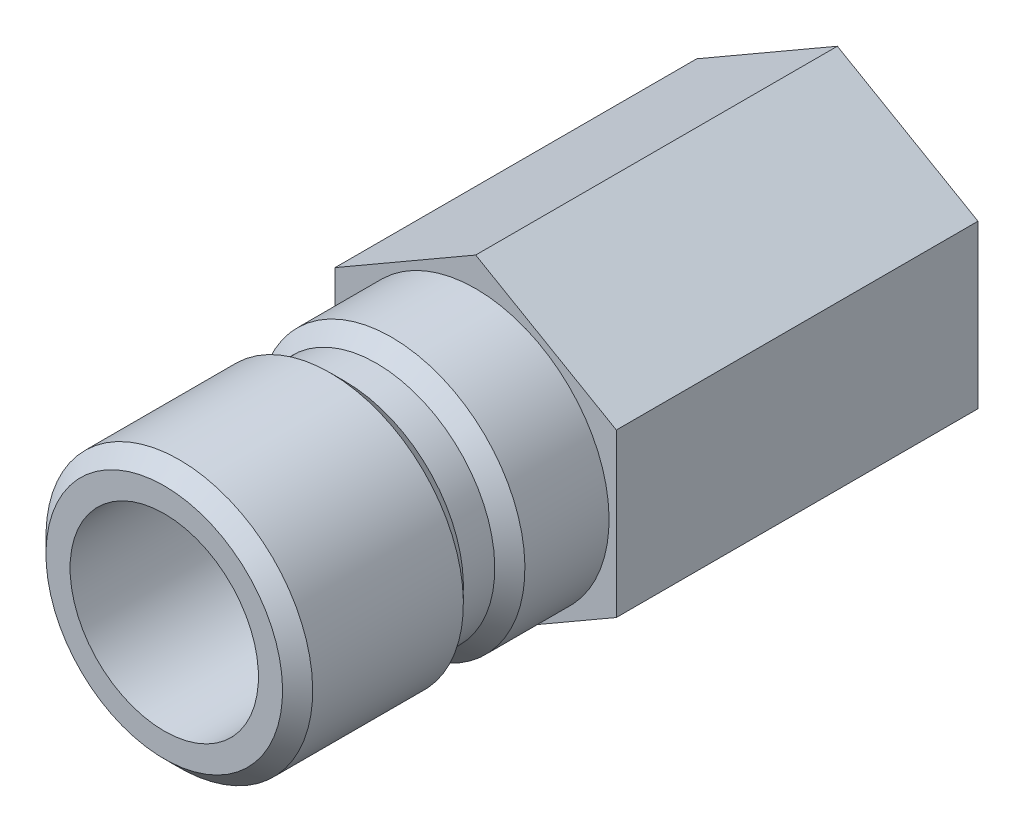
from build123d import *

# Parameters (mm, degrees)
SKETCH2_OUTSIDE_W  = 27.872
SKETCH2_OUTSIDE_H  = 27.872
CUT_EXTRUDE1_DEPTH = 23.066272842


with BuildPart() as part:
    # Sketch1 → Revolve1 (revolve)
    with BuildSketch(Plane(origin=(0, 0, 0), x_dir=(0, 0, -1), z_dir=(1, 0, 0))):
        Polygon((-15.748, 4.7625), (-15.748, 5.9817), (-14.986, 6.7437), (-7.366, 6.7437), (-6.604, 5.9817), (-5.0165, 5.9817), (-4.2545, 6.7437), (0, 6.7437), (0, 8.73125), (18.288, 8.73125), (18.288, 5.951138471), (6.6675, 5.588), (6.6675, 4.7625), align=None)
    revolve(axis=Axis((0, 0, 0), (0, 0, 1)))

    # Sketch2 outside → Cut-Extrude1 (cut, through all)
    with BuildSketch(Plane.XY):
        Rectangle(SKETCH2_OUTSIDE_W, SKETCH2_OUTSIDE_H)
        Polygon((-7.112, 4.106115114), (-7.112, -4.106115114), (0, -8.212230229), (7.112, -4.106115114), (7.112, 4.106115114), (0, 8.212230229), align=None, mode=Mode.SUBTRACT)
    extrude(amount=-CUT_EXTRUDE1_DEPTH, mode=Mode.SUBTRACT)


solid = part.part
